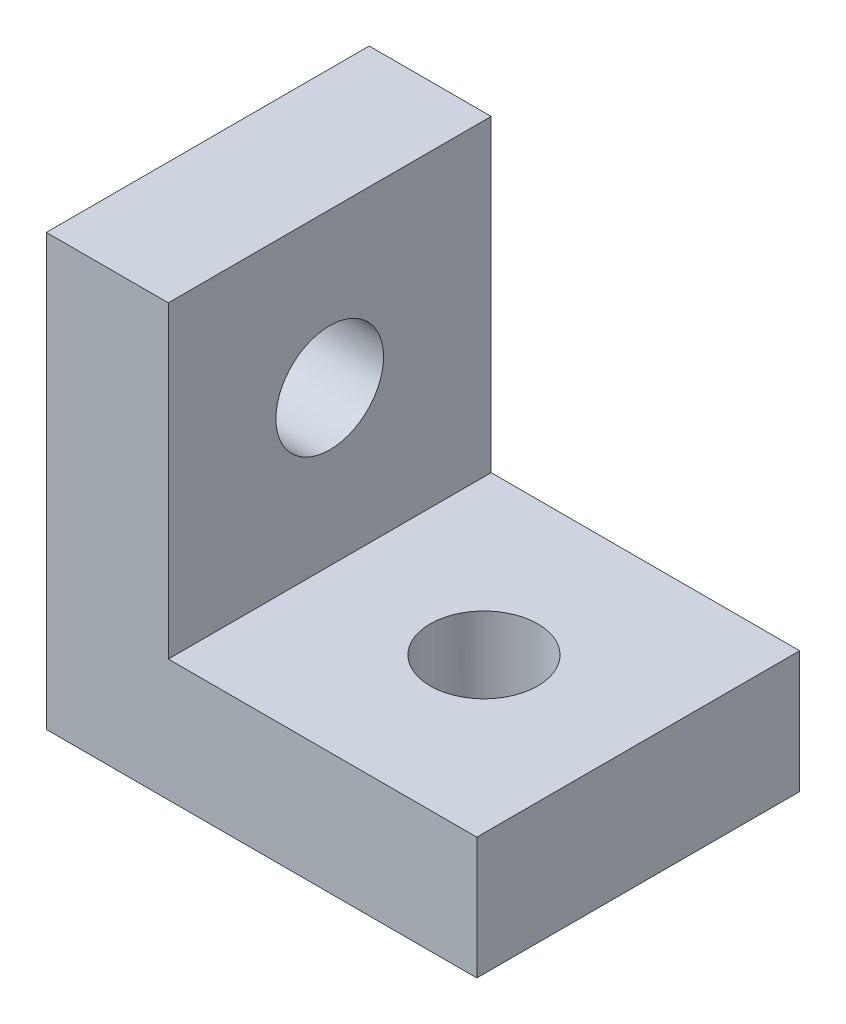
from build123d import *

# Parameters (mm, degrees)
EXTRUDE1_DEPTH     = 57.15
SKETCH9_R          = 9.525
CUT_EXTRUDE3_DEPTH = 165.564877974
SKETCH10_R         = 9.525
CUT_EXTRUDE4_DEPTH = 166.023660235


with BuildPart() as part:
    # Sketch6 → Extrude1 (new body)
    with BuildSketch(Plane(origin=(31.75, 112.7125, -77.7875), x_dir=(1, 0, 0), z_dir=(0, 0, 1))):
        Polygon((0, -96.8375), (76.2, -96.8375), (76.2, -75.2475), (21.59, -75.2475), (21.59, -20.6375), (0, -20.6375), align=None)
    extrude(amount=EXTRUDE1_DEPTH)

    # Sketch9 → Cut-Extrude3 (cut, through all)
    with BuildSketch(Plane(origin=(0, 112.7125, 0), x_dir=(-1, 0, 0), z_dir=(0, 1, 0))):
        with Locations(Location((-80.645, -49.2125, 0), (0, 0, 90))):
            Circle(SKETCH9_R)
    extrude(amount=-CUT_EXTRUDE3_DEPTH, mode=Mode.SUBTRACT)

    # Sketch10 → Cut-Extrude4 (cut, through all)
    with BuildSketch(Plane(origin=(144.4625, 0, 0), x_dir=(0, 0, -1), z_dir=(1, 0, 0))):
        with Locations((49.2125, 64.77)):
            Circle(SKETCH10_R)
    extrude(amount=-CUT_EXTRUDE4_DEPTH, mode=Mode.SUBTRACT)


solid = part.part
